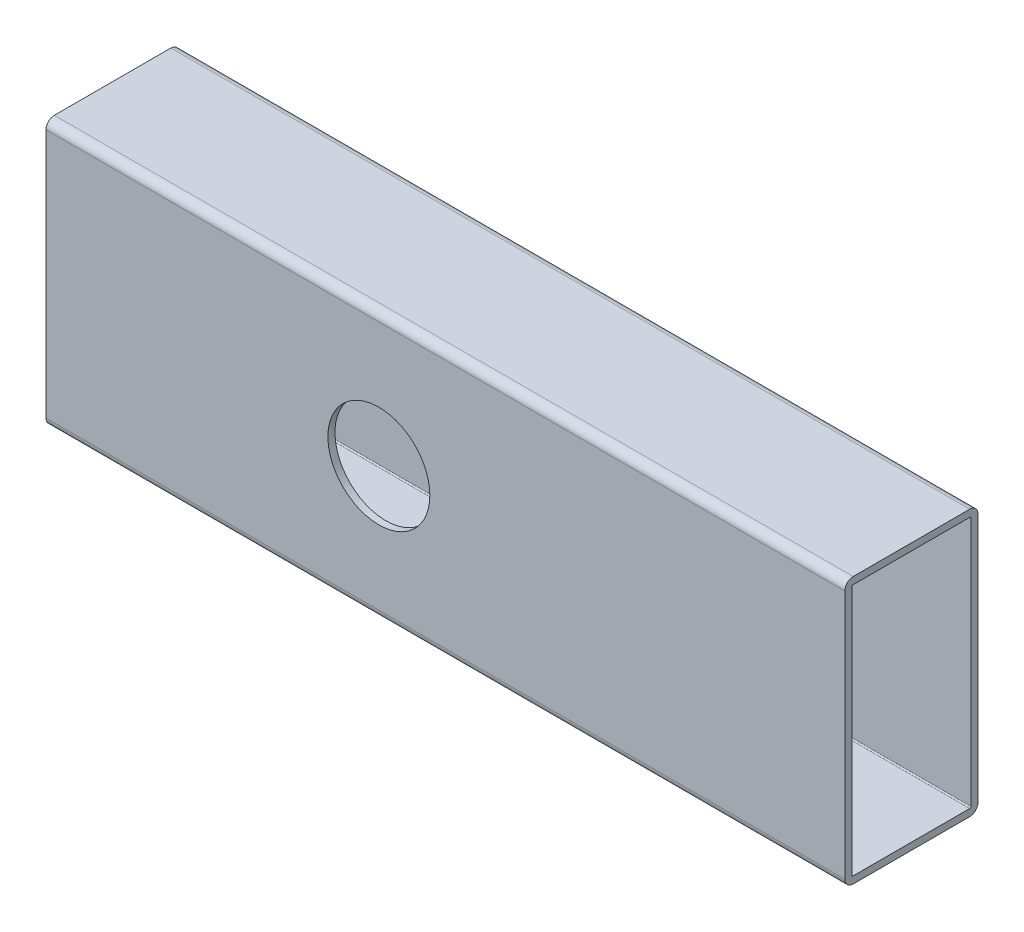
from build123d import *

# Parameters (mm, degrees)
EXTRUDE1_DEPTH          = 152.4
CUT_EXTRUDE1_DEPTH      = 161.871602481
CUT_EXTRUDE1_DEPTH_BACK = 161.871602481
SKETCH3_R               = 9.7234375


with BuildPart() as part:
    # Sketch1 → Extrude1 (new body)
    with BuildSketch(Plane(origin=(0, 0, 0), x_dir=(0, 0, -1), z_dir=(1, 0, 0))):
        with BuildLine():
            Line((-5.373037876, 5.244240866), (16.851962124, 5.244240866))
            ThreePointArc((16.851962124, 5.244240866), (17.974494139, 4.779272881), (18.439462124, 3.656740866))
            Line((18.439462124, 3.656740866), (18.439462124, -43.968259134))
            ThreePointArc((18.439462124, -43.968259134), (17.974494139, -45.090791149), (16.851962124, -45.555759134))
            Line((16.851962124, -45.555759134), (-5.373037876, -45.555759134))
            ThreePointArc((-5.373037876, -45.555759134), (-6.495569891, -45.090791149), (-6.960537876, -43.968259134))
            Line((-6.960537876, -43.968259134), (-6.960537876, 3.656740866))
            ThreePointArc((-6.960537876, 3.656740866), (-6.495569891, 4.779272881), (-5.373037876, 5.244240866))
        make_face()
        with BuildLine():
            Line((-5.373037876, 3.898040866), (16.851962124, 3.898040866))
            ThreePointArc((16.851962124, 3.898040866), (17.02258699, 3.827365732), (17.093262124, 3.656740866))
            Line((17.093262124, 3.656740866), (17.093262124, -43.968259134))
            ThreePointArc((17.093262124, -43.968259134), (17.02258699, -44.138884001), (16.851962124, -44.209559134))
            Line((16.851962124, -44.209559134), (-5.373037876, -44.209559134))
            ThreePointArc((-5.373037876, -44.209559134), (-5.543662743, -44.138884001), (-5.614337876, -43.968259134))
            Line((-5.614337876, -43.968259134), (-5.614337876, 3.656740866))
            ThreePointArc((-5.614337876, 3.656740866), (-5.543662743, 3.827365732), (-5.373037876, 3.898040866))
        make_face(mode=Mode.SUBTRACT)
    extrude(amount=EXTRUDE1_DEPTH)

    # Sketch3 → Cut-Extrude1 (cut, two sides: drawn at the far end of the back side and taken through both)
    with BuildSketch(Plane.XY.offset(-17.093262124).offset(-CUT_EXTRUDE1_DEPTH_BACK)):
        with Locations((63.5, -20.155759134)):
            Circle(SKETCH3_R)
    extrude(amount=CUT_EXTRUDE1_DEPTH + CUT_EXTRUDE1_DEPTH_BACK, mode=Mode.SUBTRACT)


solid = part.part
